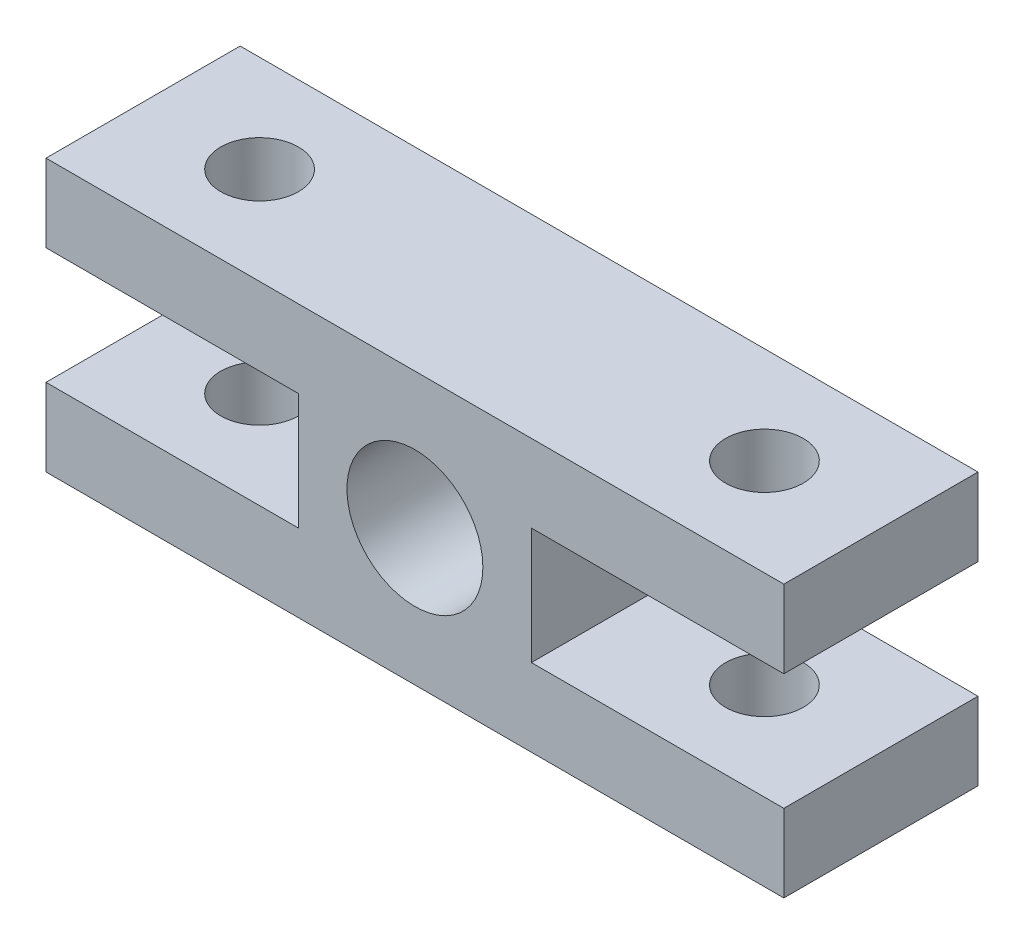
ISO-10303-21;
HEADER;
FILE_DESCRIPTION(('STEP AP214'),'2;1');
FILE_NAME('part.step','',(''),(''),'','','');
FILE_SCHEMA(('AUTOMOTIVE_DESIGN { 1 0 10303 214 1 1 1 1 }'));
ENDSEC;
DATA;
#1=APPLICATION_CONTEXT('core data for automotive mechanical design processes');
#2=APPLICATION_PROTOCOL_DEFINITION('international standard','automotive_design',2000,#1);
#3=PRODUCT_CONTEXT('',#1,'mechanical');
#4=PRODUCT('Part','Part','',(#3));
#5=PRODUCT_RELATED_PRODUCT_CATEGORY('part','',(#4));
#6=PRODUCT_DEFINITION_FORMATION('','',#4);
#7=PRODUCT_DEFINITION_CONTEXT('part definition',#1,'design');
#8=PRODUCT_DEFINITION('design','',#6,#7);
#9=PRODUCT_DEFINITION_SHAPE('','',#8);
#10=(LENGTH_UNIT() NAMED_UNIT(*) SI_UNIT(.MILLI.,.METRE.));
#11=(NAMED_UNIT(*) PLANE_ANGLE_UNIT() SI_UNIT($,.RADIAN.));
#12=(NAMED_UNIT(*) SI_UNIT($,.STERADIAN.) SOLID_ANGLE_UNIT());
#13=UNCERTAINTY_MEASURE_WITH_UNIT(LENGTH_MEASURE(1.E-05),#10,'distance_accuracy_value','');
#14=(GEOMETRIC_REPRESENTATION_CONTEXT(3) GLOBAL_UNCERTAINTY_ASSIGNED_CONTEXT((#13)) GLOBAL_UNIT_ASSIGNED_CONTEXT((#10,
#11,#12)) REPRESENTATION_CONTEXT('',''));
#15=CARTESIAN_POINT('',(0.,0.,0.));
#16=DIRECTION('',(0.,0.,1.));
#17=DIRECTION('',(1.,0.,0.));
#18=AXIS2_PLACEMENT_3D('',#15,#16,#17);
#19=CARTESIAN_POINT('',(-38.,14.,20.));
#20=DIRECTION('',(1.,0.,0.));
#21=DIRECTION('',(0.,0.,-1.));
#22=AXIS2_PLACEMENT_3D('',#19,#20,#21);
#23=PLANE('',#22);
#24=DIRECTION('',(0.,-1.,0.));
#25=VECTOR('',#24,1.);
#26=CARTESIAN_POINT('',(-38.,14.,0.));
#27=LINE('',#26,#25);
#28=CARTESIAN_POINT('',(-38.,14.,0.));
#29=VERTEX_POINT('',#28);
#30=CARTESIAN_POINT('',(-38.,6.,0.));
#31=VERTEX_POINT('',#30);
#32=EDGE_CURVE('E156',#29,#31,#27,.T.);
#33=ORIENTED_EDGE('',*,*,#32,.T.);
#34=DIRECTION('',(0.,0.,-1.));
#35=VECTOR('',#34,1.);
#36=CARTESIAN_POINT('',(-38.,6.,20.));
#37=LINE('',#36,#35);
#38=CARTESIAN_POINT('',(-38.,6.,20.));
#39=VERTEX_POINT('',#38);
#40=EDGE_CURVE('E11',#39,#31,#37,.T.);
#41=ORIENTED_EDGE('',*,*,#40,.F.);
#42=DIRECTION('',(0.,-1.,0.));
#43=VECTOR('',#42,1.);
#44=CARTESIAN_POINT('',(-38.,14.,20.));
#45=LINE('',#44,#43);
#46=CARTESIAN_POINT('',(-38.,14.,20.));
#47=VERTEX_POINT('',#46);
#48=EDGE_CURVE('E179',#47,#39,#45,.T.);
#49=ORIENTED_EDGE('',*,*,#48,.F.);
#50=DIRECTION('',(0.,0.,-1.));
#51=VECTOR('',#50,1.);
#52=CARTESIAN_POINT('',(-38.,14.,20.));
#53=LINE('',#52,#51);
#54=EDGE_CURVE('E152',#47,#29,#53,.T.);
#55=ORIENTED_EDGE('',*,*,#54,.T.);
#56=EDGE_LOOP('',(#33,#41,#49,#55));
#57=FACE_BOUND('',#56,.T.);
#58=ADVANCED_FACE('F34',(#57),#23,.F.);
#59=CARTESIAN_POINT('',(-38.,6.,20.));
#60=DIRECTION('',(0.,1.,0.));
#61=DIRECTION('',(0.,0.,1.));
#62=AXIS2_PLACEMENT_3D('',#59,#60,#61);
#63=PLANE('',#62);
#64=CARTESIAN_POINT('',(-26.,6.,10.));
#65=DIRECTION('',(0.,1.,0.));
#66=DIRECTION('',(0.,0.,1.));
#67=AXIS2_PLACEMENT_3D('',#64,#65,#66);
#68=CIRCLE('',#67,4.00000000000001);
#69=CARTESIAN_POINT('',(-26.,6.,14.));
#70=VERTEX_POINT('',#69);
#71=EDGE_CURVE('E212',#70,#70,#68,.F.);
#72=ORIENTED_EDGE('',*,*,#71,.F.);
#73=EDGE_LOOP('',(#72));
#74=FACE_BOUND('',#73,.T.);
#75=DIRECTION('',(1.,0.,0.));
#76=VECTOR('',#75,1.);
#77=CARTESIAN_POINT('',(-38.,6.,0.));
#78=LINE('',#77,#76);
#79=CARTESIAN_POINT('',(-12.,6.,0.));
#80=VERTEX_POINT('',#79);
#81=EDGE_CURVE('E159',#31,#80,#78,.T.);
#82=ORIENTED_EDGE('',*,*,#81,.T.);
#83=DIRECTION('',(0.,0.,-1.));
#84=VECTOR('',#83,1.);
#85=CARTESIAN_POINT('',(-12.,6.,20.));
#86=LINE('',#85,#84);
#87=CARTESIAN_POINT('',(-12.,6.,20.));
#88=VERTEX_POINT('',#87);
#89=EDGE_CURVE('E43',#88,#80,#86,.T.);
#90=ORIENTED_EDGE('',*,*,#89,.F.);
#91=DIRECTION('',(1.,0.,0.));
#92=VECTOR('',#91,1.);
#93=CARTESIAN_POINT('',(-38.,6.,20.));
#94=LINE('',#93,#92);
#95=EDGE_CURVE('E107',#39,#88,#94,.T.);
#96=ORIENTED_EDGE('',*,*,#95,.F.);
#97=ORIENTED_EDGE('',*,*,#40,.T.);
#98=EDGE_LOOP('',(#82,#90,#96,#97));
#99=FACE_BOUND('',#98,.T.);
#100=ADVANCED_FACE('F272',(#74,#99),#63,.F.);
#101=CARTESIAN_POINT('',(-12.,6.,20.));
#102=DIRECTION('',(1.,0.,0.));
#103=DIRECTION('',(0.,1.,0.));
#104=AXIS2_PLACEMENT_3D('',#101,#102,#103);
#105=PLANE('',#104);
#106=DIRECTION('',(0.,-1.,0.));
#107=VECTOR('',#106,1.);
#108=CARTESIAN_POINT('',(-12.,6.,0.));
#109=LINE('',#108,#107);
#110=CARTESIAN_POINT('',(-12.,-6.,0.));
#111=VERTEX_POINT('',#110);
#112=EDGE_CURVE('E162',#80,#111,#109,.T.);
#113=ORIENTED_EDGE('',*,*,#112,.T.);
#114=DIRECTION('',(0.,0.,-1.));
#115=VECTOR('',#114,1.);
#116=CARTESIAN_POINT('',(-12.,-6.,20.));
#117=LINE('',#116,#115);
#118=CARTESIAN_POINT('',(-12.,-6.,20.));
#119=VERTEX_POINT('',#118);
#120=EDGE_CURVE('E198',#119,#111,#117,.T.);
#121=ORIENTED_EDGE('',*,*,#120,.F.);
#122=DIRECTION('',(0.,-1.,0.));
#123=VECTOR('',#122,1.);
#124=CARTESIAN_POINT('',(-12.,6.,20.));
#125=LINE('',#124,#123);
#126=EDGE_CURVE('E230',#88,#119,#125,.T.);
#127=ORIENTED_EDGE('',*,*,#126,.F.);
#128=ORIENTED_EDGE('',*,*,#89,.T.);
#129=EDGE_LOOP('',(#113,#121,#127,#128));
#130=FACE_BOUND('',#129,.T.);
#131=ADVANCED_FACE('F276',(#130),#105,.F.);
#132=CARTESIAN_POINT('',(-38.,-6.,20.));
#133=DIRECTION('',(0.,-1.,0.));
#134=DIRECTION('',(1.,0.,0.));
#135=AXIS2_PLACEMENT_3D('',#132,#133,#134);
#136=PLANE('',#135);
#137=CARTESIAN_POINT('',(-26.,-6.,10.));
#138=DIRECTION('',(0.,-1.,0.));
#139=DIRECTION('',(1.,0.,0.));
#140=AXIS2_PLACEMENT_3D('',#137,#138,#139);
#141=CIRCLE('',#140,4.00000000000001);
#142=CARTESIAN_POINT('',(-22.,-6.,10.));
#143=VERTEX_POINT('',#142);
#144=EDGE_CURVE('E217',#143,#143,#141,.F.);
#145=ORIENTED_EDGE('',*,*,#144,.F.);
#146=EDGE_LOOP('',(#145));
#147=FACE_BOUND('',#146,.T.);
#148=DIRECTION('',(-1.,0.,0.));
#149=VECTOR('',#148,1.);
#150=CARTESIAN_POINT('',(-38.,-6.,0.));
#151=LINE('',#150,#149);
#152=CARTESIAN_POINT('',(-38.,-6.,0.));
#153=VERTEX_POINT('',#152);
#154=EDGE_CURVE('E164',#111,#153,#151,.T.);
#155=ORIENTED_EDGE('',*,*,#154,.T.);
#156=DIRECTION('',(0.,0.,-1.));
#157=VECTOR('',#156,1.);
#158=CARTESIAN_POINT('',(-38.,-6.,20.));
#159=LINE('',#158,#157);
#160=CARTESIAN_POINT('',(-38.,-6.,20.));
#161=VERTEX_POINT('',#160);
#162=EDGE_CURVE('E195',#161,#153,#159,.T.);
#163=ORIENTED_EDGE('',*,*,#162,.F.);
#164=DIRECTION('',(-1.,0.,0.));
#165=VECTOR('',#164,1.);
#166=CARTESIAN_POINT('',(-38.,-6.,20.));
#167=LINE('',#166,#165);
#168=EDGE_CURVE('E232',#119,#161,#167,.T.);
#169=ORIENTED_EDGE('',*,*,#168,.F.);
#170=ORIENTED_EDGE('',*,*,#120,.T.);
#171=EDGE_LOOP('',(#155,#163,#169,#170));
#172=FACE_BOUND('',#171,.T.);
#173=ADVANCED_FACE('F281',(#147,#172),#136,.F.);
#174=CARTESIAN_POINT('',(-38.,-6.,20.));
#175=DIRECTION('',(1.,0.,0.));
#176=DIRECTION('',(0.,0.,-1.));
#177=AXIS2_PLACEMENT_3D('',#174,#175,#176);
#178=PLANE('',#177);
#179=DIRECTION('',(0.,-1.,0.));
#180=VECTOR('',#179,1.);
#181=CARTESIAN_POINT('',(-38.,-6.,0.));
#182=LINE('',#181,#180);
#183=CARTESIAN_POINT('',(-38.,-14.,0.));
#184=VERTEX_POINT('',#183);
#185=EDGE_CURVE('E166',#153,#184,#182,.T.);
#186=ORIENTED_EDGE('',*,*,#185,.T.);
#187=DIRECTION('',(0.,0.,-1.));
#188=VECTOR('',#187,1.);
#189=CARTESIAN_POINT('',(-38.,-14.,20.));
#190=LINE('',#189,#188);
#191=CARTESIAN_POINT('',(-38.,-14.,20.));
#192=VERTEX_POINT('',#191);
#193=EDGE_CURVE('E192',#192,#184,#190,.T.);
#194=ORIENTED_EDGE('',*,*,#193,.F.);
#195=DIRECTION('',(0.,-1.,0.));
#196=VECTOR('',#195,1.);
#197=CARTESIAN_POINT('',(-38.,-6.,20.));
#198=LINE('',#197,#196);
#199=EDGE_CURVE('E234',#161,#192,#198,.T.);
#200=ORIENTED_EDGE('',*,*,#199,.F.);
#201=ORIENTED_EDGE('',*,*,#162,.T.);
#202=EDGE_LOOP('',(#186,#194,#200,#201));
#203=FACE_BOUND('',#202,.T.);
#204=ADVANCED_FACE('F288',(#203),#178,.F.);
#205=CARTESIAN_POINT('',(-38.,-14.,20.));
#206=DIRECTION('',(0.,1.,0.));
#207=DIRECTION('',(0.,0.,1.));
#208=AXIS2_PLACEMENT_3D('',#205,#206,#207);
#209=PLANE('',#208);
#210=CARTESIAN_POINT('',(-26.,-14.,10.));
#211=DIRECTION('',(0.,1.,0.));
#212=DIRECTION('',(0.,0.,-1.));
#213=AXIS2_PLACEMENT_3D('',#210,#211,#212);
#214=CIRCLE('',#213,4.00000000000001);
#215=CARTESIAN_POINT('',(-26.,-14.,5.99999999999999));
#216=VERTEX_POINT('',#215);
#217=EDGE_CURVE('E411',#216,#216,#214,.T.);
#218=ORIENTED_EDGE('',*,*,#217,.T.);
#219=EDGE_LOOP('',(#218));
#220=FACE_BOUND('',#219,.T.);
#221=CARTESIAN_POINT('',(26.,-14.,10.));
#222=DIRECTION('',(0.,-1.,0.));
#223=DIRECTION('',(0.,0.,-1.));
#224=AXIS2_PLACEMENT_3D('',#221,#222,#223);
#225=CIRCLE('',#224,4.00000000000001);
#226=CARTESIAN_POINT('',(26.,-14.,5.99999999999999));
#227=VERTEX_POINT('',#226);
#228=EDGE_CURVE('E205',#227,#227,#225,.T.);
#229=ORIENTED_EDGE('',*,*,#228,.F.);
#230=EDGE_LOOP('',(#229));
#231=FACE_BOUND('',#230,.T.);
#232=DIRECTION('',(1.,0.,0.));
#233=VECTOR('',#232,1.);
#234=CARTESIAN_POINT('',(-38.,-14.,0.));
#235=LINE('',#234,#233);
#236=CARTESIAN_POINT('',(38.,-14.,0.));
#237=VERTEX_POINT('',#236);
#238=EDGE_CURVE('E168',#184,#237,#235,.T.);
#239=ORIENTED_EDGE('',*,*,#238,.T.);
#240=DIRECTION('',(0.,0.,-1.));
#241=VECTOR('',#240,1.);
#242=CARTESIAN_POINT('',(38.,-14.,20.));
#243=LINE('',#242,#241);
#244=CARTESIAN_POINT('',(38.,-14.,20.));
#245=VERTEX_POINT('',#244);
#246=EDGE_CURVE('E189',#245,#237,#243,.T.);
#247=ORIENTED_EDGE('',*,*,#246,.F.);
#248=DIRECTION('',(1.,0.,0.));
#249=VECTOR('',#248,1.);
#250=CARTESIAN_POINT('',(-38.,-14.,20.));
#251=LINE('',#250,#249);
#252=EDGE_CURVE('E236',#192,#245,#251,.T.);
#253=ORIENTED_EDGE('',*,*,#252,.F.);
#254=ORIENTED_EDGE('',*,*,#193,.T.);
#255=EDGE_LOOP('',(#239,#247,#253,#254));
#256=FACE_BOUND('',#255,.T.);
#257=ADVANCED_FACE('F292',(#220,#231,#256),#209,.F.);
#258=CARTESIAN_POINT('',(38.,-6.,20.));
#259=DIRECTION('',(-1.,0.,0.));
#260=DIRECTION('',(0.,0.,1.));
#261=AXIS2_PLACEMENT_3D('',#258,#259,#260);
#262=PLANE('',#261);
#263=DIRECTION('',(0.,1.,0.));
#264=VECTOR('',#263,1.);
#265=CARTESIAN_POINT('',(38.,-6.,0.));
#266=LINE('',#265,#264);
#267=CARTESIAN_POINT('',(38.,-6.,0.));
#268=VERTEX_POINT('',#267);
#269=EDGE_CURVE('E170',#237,#268,#266,.T.);
#270=ORIENTED_EDGE('',*,*,#269,.T.);
#271=DIRECTION('',(0.,0.,-1.));
#272=VECTOR('',#271,1.);
#273=CARTESIAN_POINT('',(38.,-6.,20.));
#274=LINE('',#273,#272);
#275=CARTESIAN_POINT('',(38.,-6.,20.));
#276=VERTEX_POINT('',#275);
#277=EDGE_CURVE('E186',#276,#268,#274,.T.);
#278=ORIENTED_EDGE('',*,*,#277,.F.);
#279=DIRECTION('',(0.,1.,0.));
#280=VECTOR('',#279,1.);
#281=CARTESIAN_POINT('',(38.,-6.,20.));
#282=LINE('',#281,#280);
#283=EDGE_CURVE('E238',#245,#276,#282,.T.);
#284=ORIENTED_EDGE('',*,*,#283,.F.);
#285=ORIENTED_EDGE('',*,*,#246,.T.);
#286=EDGE_LOOP('',(#270,#278,#284,#285));
#287=FACE_BOUND('',#286,.T.);
#288=ADVANCED_FACE('F296',(#287),#262,.F.);
#289=CARTESIAN_POINT('',(12.,-6.,20.));
#290=DIRECTION('',(0.,-1.,0.));
#291=DIRECTION('',(0.,0.,-1.));
#292=AXIS2_PLACEMENT_3D('',#289,#290,#291);
#293=PLANE('',#292);
#294=CARTESIAN_POINT('',(26.,-6.,10.));
#295=DIRECTION('',(0.,-1.,0.));
#296=DIRECTION('',(0.,0.,-1.));
#297=AXIS2_PLACEMENT_3D('',#294,#295,#296);
#298=CIRCLE('',#297,4.00000000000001);
#299=CARTESIAN_POINT('',(26.,-6.,5.99999999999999));
#300=VERTEX_POINT('',#299);
#301=EDGE_CURVE('E209',#300,#300,#298,.T.);
#302=ORIENTED_EDGE('',*,*,#301,.T.);
#303=EDGE_LOOP('',(#302));
#304=FACE_BOUND('',#303,.T.);
#305=DIRECTION('',(-1.,0.,0.));
#306=VECTOR('',#305,1.);
#307=CARTESIAN_POINT('',(12.,-6.,0.));
#308=LINE('',#307,#306);
#309=CARTESIAN_POINT('',(12.,-6.,0.));
#310=VERTEX_POINT('',#309);
#311=EDGE_CURVE('E172',#268,#310,#308,.T.);
#312=ORIENTED_EDGE('',*,*,#311,.T.);
#313=DIRECTION('',(0.,0.,-1.));
#314=VECTOR('',#313,1.);
#315=CARTESIAN_POINT('',(12.,-6.,20.));
#316=LINE('',#315,#314);
#317=CARTESIAN_POINT('',(12.,-6.,20.));
#318=VERTEX_POINT('',#317);
#319=EDGE_CURVE('E183',#318,#310,#316,.T.);
#320=ORIENTED_EDGE('',*,*,#319,.F.);
#321=DIRECTION('',(-1.,0.,0.));
#322=VECTOR('',#321,1.);
#323=CARTESIAN_POINT('',(12.,-6.,20.));
#324=LINE('',#323,#322);
#325=EDGE_CURVE('E240',#276,#318,#324,.T.);
#326=ORIENTED_EDGE('',*,*,#325,.F.);
#327=ORIENTED_EDGE('',*,*,#277,.T.);
#328=EDGE_LOOP('',(#312,#320,#326,#327));
#329=FACE_BOUND('',#328,.T.);
#330=ADVANCED_FACE('F246',(#304,#329),#293,.F.);
#331=CARTESIAN_POINT('',(12.,6.,20.));
#332=DIRECTION('',(-1.,0.,0.));
#333=DIRECTION('',(0.,-1.,0.));
#334=AXIS2_PLACEMENT_3D('',#331,#332,#333);
#335=PLANE('',#334);
#336=DIRECTION('',(0.,1.,0.));
#337=VECTOR('',#336,1.);
#338=CARTESIAN_POINT('',(12.,6.,0.));
#339=LINE('',#338,#337);
#340=CARTESIAN_POINT('',(12.,6.,0.));
#341=VERTEX_POINT('',#340);
#342=EDGE_CURVE('E174',#310,#341,#339,.T.);
#343=ORIENTED_EDGE('',*,*,#342,.T.);
#344=DIRECTION('',(0.,0.,-1.));
#345=VECTOR('',#344,1.);
#346=CARTESIAN_POINT('',(12.,6.,20.));
#347=LINE('',#346,#345);
#348=CARTESIAN_POINT('',(12.,6.,20.));
#349=VERTEX_POINT('',#348);
#350=EDGE_CURVE('E147',#349,#341,#347,.T.);
#351=ORIENTED_EDGE('',*,*,#350,.F.);
#352=DIRECTION('',(0.,1.,0.));
#353=VECTOR('',#352,1.);
#354=CARTESIAN_POINT('',(12.,6.,20.));
#355=LINE('',#354,#353);
#356=EDGE_CURVE('E138',#318,#349,#355,.T.);
#357=ORIENTED_EDGE('',*,*,#356,.F.);
#358=ORIENTED_EDGE('',*,*,#319,.T.);
#359=EDGE_LOOP('',(#343,#351,#357,#358));
#360=FACE_BOUND('',#359,.T.);
#361=ADVANCED_FACE('F250',(#360),#335,.F.);
#362=CARTESIAN_POINT('',(12.,6.,20.));
#363=DIRECTION('',(0.,1.,0.));
#364=DIRECTION('',(0.,0.,1.));
#365=AXIS2_PLACEMENT_3D('',#362,#363,#364);
#366=PLANE('',#365);
#367=CARTESIAN_POINT('',(26.,6.,10.));
#368=DIRECTION('',(0.,1.,0.));
#369=DIRECTION('',(0.,0.,1.));
#370=AXIS2_PLACEMENT_3D('',#367,#368,#369);
#371=CIRCLE('',#370,4.00000000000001);
#372=CARTESIAN_POINT('',(26.,6.,14.));
#373=VERTEX_POINT('',#372);
#374=EDGE_CURVE('E204',#373,#373,#371,.T.);
#375=ORIENTED_EDGE('',*,*,#374,.T.);
#376=EDGE_LOOP('',(#375));
#377=FACE_BOUND('',#376,.T.);
#378=DIRECTION('',(1.,0.,0.));
#379=VECTOR('',#378,1.);
#380=CARTESIAN_POINT('',(12.,6.,0.));
#381=LINE('',#380,#379);
#382=CARTESIAN_POINT('',(38.,6.,0.));
#383=VERTEX_POINT('',#382);
#384=EDGE_CURVE('E146',#341,#383,#381,.T.);
#385=ORIENTED_EDGE('',*,*,#384,.T.);
#386=DIRECTION('',(0.,0.,-1.));
#387=VECTOR('',#386,1.);
#388=CARTESIAN_POINT('',(38.,6.,20.));
#389=LINE('',#388,#387);
#390=CARTESIAN_POINT('',(38.,6.,20.));
#391=VERTEX_POINT('',#390);
#392=EDGE_CURVE('E143',#391,#383,#389,.T.);
#393=ORIENTED_EDGE('',*,*,#392,.F.);
#394=DIRECTION('',(1.,0.,0.));
#395=VECTOR('',#394,1.);
#396=CARTESIAN_POINT('',(12.,6.,20.));
#397=LINE('',#396,#395);
#398=EDGE_CURVE('E132',#349,#391,#397,.T.);
#399=ORIENTED_EDGE('',*,*,#398,.F.);
#400=ORIENTED_EDGE('',*,*,#350,.T.);
#401=EDGE_LOOP('',(#385,#393,#399,#400));
#402=FACE_BOUND('',#401,.T.);
#403=ADVANCED_FACE('F144',(#377,#402),#366,.F.);
#404=CARTESIAN_POINT('',(38.,14.,20.));
#405=DIRECTION('',(-1.,0.,0.));
#406=DIRECTION('',(0.,0.,1.));
#407=AXIS2_PLACEMENT_3D('',#404,#405,#406);
#408=PLANE('',#407);
#409=DIRECTION('',(0.,1.,0.));
#410=VECTOR('',#409,1.);
#411=CARTESIAN_POINT('',(38.,14.,0.));
#412=LINE('',#411,#410);
#413=CARTESIAN_POINT('',(38.,14.,0.));
#414=VERTEX_POINT('',#413);
#415=EDGE_CURVE('E93',#383,#414,#412,.T.);
#416=ORIENTED_EDGE('',*,*,#415,.T.);
#417=DIRECTION('',(0.,0.,-1.));
#418=VECTOR('',#417,1.);
#419=CARTESIAN_POINT('',(38.,14.,20.));
#420=LINE('',#419,#418);
#421=CARTESIAN_POINT('',(38.,14.,20.));
#422=VERTEX_POINT('',#421);
#423=EDGE_CURVE('E148',#422,#414,#420,.T.);
#424=ORIENTED_EDGE('',*,*,#423,.F.);
#425=DIRECTION('',(0.,1.,0.));
#426=VECTOR('',#425,1.);
#427=CARTESIAN_POINT('',(38.,14.,20.));
#428=LINE('',#427,#426);
#429=EDGE_CURVE('E136',#391,#422,#428,.T.);
#430=ORIENTED_EDGE('',*,*,#429,.F.);
#431=ORIENTED_EDGE('',*,*,#392,.T.);
#432=EDGE_LOOP('',(#416,#424,#430,#431));
#433=FACE_BOUND('',#432,.T.);
#434=ADVANCED_FACE('F150',(#433),#408,.F.);
#435=CARTESIAN_POINT('',(-38.,14.,20.));
#436=DIRECTION('',(0.,-1.,0.));
#437=DIRECTION('',(0.,0.,-1.));
#438=AXIS2_PLACEMENT_3D('',#435,#436,#437);
#439=PLANE('',#438);
#440=CARTESIAN_POINT('',(-26.,14.,10.));
#441=DIRECTION('',(0.,-1.,0.));
#442=DIRECTION('',(0.,0.,-1.));
#443=AXIS2_PLACEMENT_3D('',#440,#441,#442);
#444=CIRCLE('',#443,4.00000000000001);
#445=CARTESIAN_POINT('',(-26.,14.,5.99999999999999));
#446=VERTEX_POINT('',#445);
#447=EDGE_CURVE('E37',#446,#446,#444,.F.);
#448=ORIENTED_EDGE('',*,*,#447,.F.);
#449=EDGE_LOOP('',(#448));
#450=FACE_BOUND('',#449,.T.);
#451=CARTESIAN_POINT('',(26.,14.,10.));
#452=DIRECTION('',(0.,-1.,0.));
#453=DIRECTION('',(0.,0.,-1.));
#454=AXIS2_PLACEMENT_3D('',#451,#452,#453);
#455=CIRCLE('',#454,4.00000000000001);
#456=CARTESIAN_POINT('',(26.,14.,5.99999999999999));
#457=VERTEX_POINT('',#456);
#458=EDGE_CURVE('E202',#457,#457,#455,.T.);
#459=ORIENTED_EDGE('',*,*,#458,.T.);
#460=EDGE_LOOP('',(#459));
#461=FACE_BOUND('',#460,.T.);
#462=DIRECTION('',(-1.,0.,0.));
#463=VECTOR('',#462,1.);
#464=CARTESIAN_POINT('',(-38.,14.,0.));
#465=LINE('',#464,#463);
#466=EDGE_CURVE('E99',#414,#29,#465,.T.);
#467=ORIENTED_EDGE('',*,*,#466,.T.);
#468=ORIENTED_EDGE('',*,*,#54,.F.);
#469=DIRECTION('',(-1.,0.,0.));
#470=VECTOR('',#469,1.);
#471=CARTESIAN_POINT('',(-38.,14.,20.));
#472=LINE('',#471,#470);
#473=EDGE_CURVE('E52',#422,#47,#472,.T.);
#474=ORIENTED_EDGE('',*,*,#473,.F.);
#475=ORIENTED_EDGE('',*,*,#423,.T.);
#476=EDGE_LOOP('',(#467,#468,#474,#475));
#477=FACE_BOUND('',#476,.T.);
#478=ADVANCED_FACE('F258',(#450,#461,#477),#439,.F.);
#479=CARTESIAN_POINT('',(-38.,6.,20.));
#480=DIRECTION('',(0.,0.,1.));
#481=DIRECTION('',(1.,0.,0.));
#482=AXIS2_PLACEMENT_3D('',#479,#480,#481);
#483=PLANE('',#482);
#484=CARTESIAN_POINT('',(0.,0.,20.));
#485=DIRECTION('',(0.,0.,1.));
#486=DIRECTION('',(1.,0.,0.));
#487=AXIS2_PLACEMENT_3D('',#484,#485,#486);
#488=CIRCLE('',#487,7.);
#489=CARTESIAN_POINT('',(7.,0.,20.));
#490=VERTEX_POINT('',#489);
#491=EDGE_CURVE('E223',#490,#490,#488,.T.);
#492=ORIENTED_EDGE('',*,*,#491,.F.);
#493=EDGE_LOOP('',(#492));
#494=FACE_BOUND('',#493,.T.);
#495=ORIENTED_EDGE('',*,*,#48,.T.);
#496=ORIENTED_EDGE('',*,*,#95,.T.);
#497=ORIENTED_EDGE('',*,*,#126,.T.);
#498=ORIENTED_EDGE('',*,*,#168,.T.);
#499=ORIENTED_EDGE('',*,*,#199,.T.);
#500=ORIENTED_EDGE('',*,*,#252,.T.);
#501=ORIENTED_EDGE('',*,*,#283,.T.);
#502=ORIENTED_EDGE('',*,*,#325,.T.);
#503=ORIENTED_EDGE('',*,*,#356,.T.);
#504=ORIENTED_EDGE('',*,*,#398,.T.);
#505=ORIENTED_EDGE('',*,*,#429,.T.);
#506=ORIENTED_EDGE('',*,*,#473,.T.);
#507=EDGE_LOOP('',(#495,#496,#497,#498,#499,#500,#501,#502,#503,#504,#505,#506));
#508=FACE_BOUND('',#507,.T.);
#509=ADVANCED_FACE('F134',(#494,#508),#483,.T.);
#510=CARTESIAN_POINT('',(-38.,6.,0.));
#511=DIRECTION('',(0.,0.,1.));
#512=DIRECTION('',(1.,0.,0.));
#513=AXIS2_PLACEMENT_3D('',#510,#511,#512);
#514=PLANE('',#513);
#515=CARTESIAN_POINT('',(0.,0.,0.));
#516=DIRECTION('',(0.,0.,1.));
#517=DIRECTION('',(1.,0.,0.));
#518=AXIS2_PLACEMENT_3D('',#515,#516,#517);
#519=CIRCLE('',#518,7.);
#520=CARTESIAN_POINT('',(7.,0.,0.));
#521=VERTEX_POINT('',#520);
#522=EDGE_CURVE('E160',#521,#521,#519,.T.);
#523=ORIENTED_EDGE('',*,*,#522,.T.);
#524=EDGE_LOOP('',(#523));
#525=FACE_BOUND('',#524,.T.);
#526=ORIENTED_EDGE('',*,*,#32,.F.);
#527=ORIENTED_EDGE('',*,*,#466,.F.);
#528=ORIENTED_EDGE('',*,*,#415,.F.);
#529=ORIENTED_EDGE('',*,*,#384,.F.);
#530=ORIENTED_EDGE('',*,*,#342,.F.);
#531=ORIENTED_EDGE('',*,*,#311,.F.);
#532=ORIENTED_EDGE('',*,*,#269,.F.);
#533=ORIENTED_EDGE('',*,*,#238,.F.);
#534=ORIENTED_EDGE('',*,*,#185,.F.);
#535=ORIENTED_EDGE('',*,*,#154,.F.);
#536=ORIENTED_EDGE('',*,*,#112,.F.);
#537=ORIENTED_EDGE('',*,*,#81,.F.);
#538=EDGE_LOOP('',(#526,#527,#528,#529,#530,#531,#532,#533,#534,#535,#536,#537));
#539=FACE_BOUND('',#538,.T.);
#540=ADVANCED_FACE('F253',(#525,#539),#514,.F.);
#541=CARTESIAN_POINT('',(0.,0.,0.));
#542=DIRECTION('',(0.,0.,1.));
#543=DIRECTION('',(1.,0.,0.));
#544=AXIS2_PLACEMENT_3D('',#541,#542,#543);
#545=CYLINDRICAL_SURFACE('',#544,7.);
#546=ORIENTED_EDGE('',*,*,#522,.F.);
#547=EDGE_LOOP('',(#546));
#548=FACE_BOUND('',#547,.T.);
#549=ORIENTED_EDGE('',*,*,#491,.T.);
#550=EDGE_LOOP('',(#549));
#551=FACE_BOUND('',#550,.T.);
#552=ADVANCED_FACE('F315',(#548,#551),#545,.F.);
#553=CARTESIAN_POINT('',(26.,19.7360409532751,10.));
#554=DIRECTION('',(0.,-1.,0.));
#555=DIRECTION('',(0.,0.,-1.));
#556=AXIS2_PLACEMENT_3D('',#553,#554,#555);
#557=CYLINDRICAL_SURFACE('',#556,4.00000000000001);
#558=ORIENTED_EDGE('',*,*,#458,.F.);
#559=EDGE_LOOP('',(#558));
#560=FACE_BOUND('',#559,.T.);
#561=ORIENTED_EDGE('',*,*,#374,.F.);
#562=EDGE_LOOP('',(#561));
#563=FACE_BOUND('',#562,.T.);
#564=ADVANCED_FACE('F312',(#560,#563),#557,.F.);
#565=ORIENTED_EDGE('',*,*,#228,.T.);
#566=EDGE_LOOP('',(#565));
#567=FACE_BOUND('',#566,.T.);
#568=ORIENTED_EDGE('',*,*,#301,.F.);
#569=EDGE_LOOP('',(#568));
#570=FACE_BOUND('',#569,.T.);
#571=ADVANCED_FACE('F314',(#567,#570),#557,.F.);
#572=CARTESIAN_POINT('',(-26.,19.7360409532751,10.));
#573=DIRECTION('',(0.,-1.,0.));
#574=DIRECTION('',(0.,0.,-1.));
#575=AXIS2_PLACEMENT_3D('',#572,#573,#574);
#576=CYLINDRICAL_SURFACE('',#575,4.00000000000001);
#577=ORIENTED_EDGE('',*,*,#447,.T.);
#578=EDGE_LOOP('',(#577));
#579=FACE_BOUND('',#578,.T.);
#580=ORIENTED_EDGE('',*,*,#71,.T.);
#581=EDGE_LOOP('',(#580));
#582=FACE_BOUND('',#581,.T.);
#583=ADVANCED_FACE('F322',(#579,#582),#576,.F.);
#584=ORIENTED_EDGE('',*,*,#217,.F.);
#585=EDGE_LOOP('',(#584));
#586=FACE_BOUND('',#585,.T.);
#587=ORIENTED_EDGE('',*,*,#144,.T.);
#588=EDGE_LOOP('',(#587));
#589=FACE_BOUND('',#588,.T.);
#590=ADVANCED_FACE('F396',(#586,#589),#576,.F.);
#591=CLOSED_SHELL('',(#58,#100,#131,#173,#204,#257,#288,#330,#361,#403,#434,#478,#509,#540,#552,
#564,#571,#583,#590));
#592=MANIFOLD_SOLID_BREP('B2',#591);
#593=ADVANCED_BREP_SHAPE_REPRESENTATION('',(#18,#592),#14);
#594=SHAPE_DEFINITION_REPRESENTATION(#9,#593);
ENDSEC;
END-ISO-10303-21;
